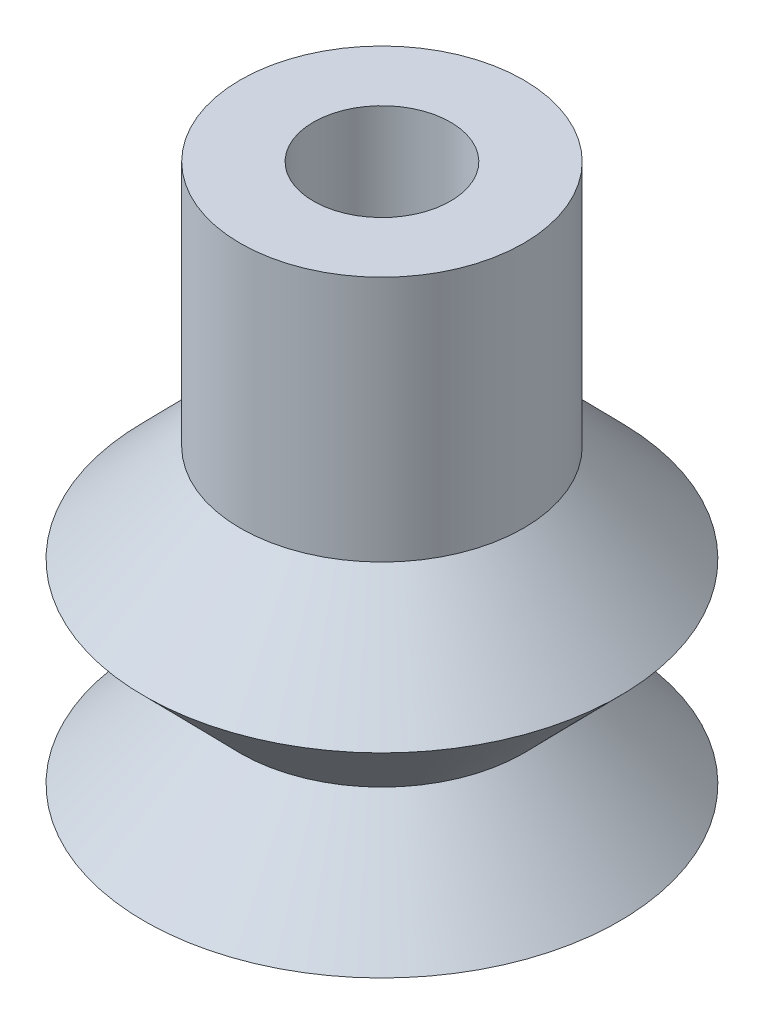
from build123d import *


with BuildPart() as part:
    # Sketch1 → Revolve1 (revolve)
    with BuildSketch(Plane.XY, mode=Mode.PRIVATE) as revolve1_sk:
        Polygon((1.905, 14.986), (1.905, 8.128), (4.572, 5.418666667), (1.905, 2.709333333), (4.572, 0), (6.604, 0), (3.937, 2.709333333), (6.604, 5.418666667), (3.937, 8.128), (3.937, 14.986), align=None)
    revolve(revolve1_sk.sketch.rotate(Axis((0, 14.986, 0), (0, -1, 0)), 180), axis=Axis((0, 14.986, 0), (0, -1, 0)))


solid = part.part
